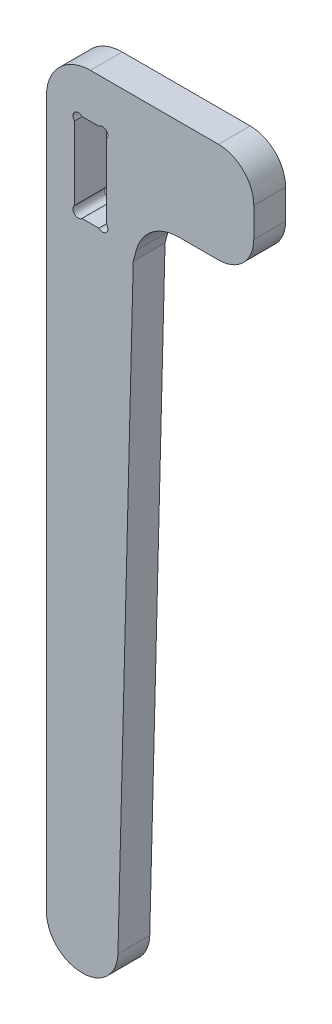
ISO-10303-21;
HEADER;
FILE_DESCRIPTION(('STEP AP214'),'2;1');
FILE_NAME('part.step','',(''),(''),'','','');
FILE_SCHEMA(('AUTOMOTIVE_DESIGN { 1 0 10303 214 1 1 1 1 }'));
ENDSEC;
DATA;
#1=APPLICATION_CONTEXT('core data for automotive mechanical design processes');
#2=APPLICATION_PROTOCOL_DEFINITION('international standard','automotive_design',2000,#1);
#3=PRODUCT_CONTEXT('',#1,'mechanical');
#4=PRODUCT('Part','Part','',(#3));
#5=PRODUCT_RELATED_PRODUCT_CATEGORY('part','',(#4));
#6=PRODUCT_DEFINITION_FORMATION('','',#4);
#7=PRODUCT_DEFINITION_CONTEXT('part definition',#1,'design');
#8=PRODUCT_DEFINITION('design','',#6,#7);
#9=PRODUCT_DEFINITION_SHAPE('','',#8);
#10=(LENGTH_UNIT() NAMED_UNIT(*) SI_UNIT(.MILLI.,.METRE.));
#11=(NAMED_UNIT(*) PLANE_ANGLE_UNIT() SI_UNIT($,.RADIAN.));
#12=(NAMED_UNIT(*) SI_UNIT($,.STERADIAN.) SOLID_ANGLE_UNIT());
#13=UNCERTAINTY_MEASURE_WITH_UNIT(LENGTH_MEASURE(1.E-05),#10,'distance_accuracy_value','');
#14=(GEOMETRIC_REPRESENTATION_CONTEXT(3) GLOBAL_UNCERTAINTY_ASSIGNED_CONTEXT((#13)) GLOBAL_UNIT_ASSIGNED_CONTEXT((#10,
#11,#12)) REPRESENTATION_CONTEXT('',''));
#15=CARTESIAN_POINT('',(0.,0.,0.));
#16=DIRECTION('',(0.,0.,1.));
#17=DIRECTION('',(1.,0.,0.));
#18=AXIS2_PLACEMENT_3D('',#15,#16,#17);
#19=CARTESIAN_POINT('',(24.9,25.1,18.));
#20=DIRECTION('',(0.,0.,-1.));
#21=DIRECTION('',(-1.,0.,0.));
#22=AXIS2_PLACEMENT_3D('',#19,#20,#21);
#23=CYLINDRICAL_SURFACE('',#22,24.9);
#24=CARTESIAN_POINT('',(24.9,25.1,0.));
#25=DIRECTION('',(0.,0.,1.));
#26=DIRECTION('',(1.,0.,0.));
#27=AXIS2_PLACEMENT_3D('',#24,#25,#26);
#28=CIRCLE('',#27,24.9);
#29=CARTESIAN_POINT('',(0.,25.0999999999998,0.));
#30=VERTEX_POINT('',#29);
#31=CARTESIAN_POINT('',(24.9000000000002,50.,0.));
#32=VERTEX_POINT('',#31);
#33=EDGE_CURVE('E246',#30,#32,#28,.F.);
#34=ORIENTED_EDGE('',*,*,#33,.F.);
#35=DIRECTION('',(0.,0.,-1.));
#36=VECTOR('',#35,1.);
#37=CARTESIAN_POINT('',(0.,25.0999999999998,18.));
#38=LINE('',#37,#36);
#39=CARTESIAN_POINT('',(0.,25.0999999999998,18.));
#40=VERTEX_POINT('',#39);
#41=EDGE_CURVE('E280',#40,#30,#38,.T.);
#42=ORIENTED_EDGE('',*,*,#41,.F.);
#43=CARTESIAN_POINT('',(24.9,25.1,18.));
#44=DIRECTION('',(0.,0.,1.));
#45=DIRECTION('',(1.,0.,0.));
#46=AXIS2_PLACEMENT_3D('',#43,#44,#45);
#47=CIRCLE('',#46,24.9);
#48=CARTESIAN_POINT('',(24.9000000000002,50.,18.));
#49=VERTEX_POINT('',#48);
#50=EDGE_CURVE('E218',#40,#49,#47,.F.);
#51=ORIENTED_EDGE('',*,*,#50,.T.);
#52=DIRECTION('',(0.,0.,-1.));
#53=VECTOR('',#52,1.);
#54=CARTESIAN_POINT('',(24.9000000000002,50.,18.));
#55=LINE('',#54,#53);
#56=EDGE_CURVE('E245',#49,#32,#55,.T.);
#57=ORIENTED_EDGE('',*,*,#56,.T.);
#58=EDGE_LOOP('',(#34,#42,#51,#57));
#59=FACE_BOUND('',#58,.T.);
#60=ADVANCED_FACE('F35',(#59),#23,.T.);
#61=CARTESIAN_POINT('',(0.,0.,18.));
#62=DIRECTION('',(1.,0.,0.));
#63=DIRECTION('',(0.,1.,0.));
#64=AXIS2_PLACEMENT_3D('',#61,#62,#63);
#65=PLANE('',#64);
#66=DIRECTION('',(0.,-1.,0.));
#67=VECTOR('',#66,1.);
#68=CARTESIAN_POINT('',(0.,0.,0.));
#69=LINE('',#68,#67);
#70=CARTESIAN_POINT('',(0.,-374.9,0.));
#71=VERTEX_POINT('',#70);
#72=EDGE_CURVE('E249',#30,#71,#69,.T.);
#73=ORIENTED_EDGE('',*,*,#72,.T.);
#74=DIRECTION('',(0.,0.,-1.));
#75=VECTOR('',#74,1.);
#76=CARTESIAN_POINT('',(0.,-374.9,18.));
#77=LINE('',#76,#75);
#78=CARTESIAN_POINT('',(0.,-374.9,18.));
#79=VERTEX_POINT('',#78);
#80=EDGE_CURVE('E309',#71,#79,#77,.F.);
#81=ORIENTED_EDGE('',*,*,#80,.T.);
#82=DIRECTION('',(0.,-1.,0.));
#83=VECTOR('',#82,1.);
#84=CARTESIAN_POINT('',(0.,0.,18.));
#85=LINE('',#84,#83);
#86=EDGE_CURVE('E221',#40,#79,#85,.T.);
#87=ORIENTED_EDGE('',*,*,#86,.F.);
#88=ORIENTED_EDGE('',*,*,#41,.T.);
#89=EDGE_LOOP('',(#73,#81,#87,#88));
#90=FACE_BOUND('',#89,.T.);
#91=ADVANCED_FACE('F373',(#90),#65,.F.);
#92=CARTESIAN_POINT('',(0.,-394.9,18.));
#93=DIRECTION('',(0.,1.,0.));
#94=DIRECTION('',(0.,0.,1.));
#95=AXIS2_PLACEMENT_3D('',#92,#93,#94);
#96=PLANE('',#95);
#97=DIRECTION('',(1.,0.,0.));
#98=VECTOR('',#97,1.);
#99=CARTESIAN_POINT('',(0.,-394.9,18.));
#100=LINE('',#99,#98);
#101=CARTESIAN_POINT('',(20.,-394.9,18.));
#102=VERTEX_POINT('',#101);
#103=CARTESIAN_POINT('',(20.4974080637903,-394.9,18.));
#104=VERTEX_POINT('',#103);
#105=EDGE_CURVE('E225',#102,#104,#100,.T.);
#106=ORIENTED_EDGE('',*,*,#105,.F.);
#107=DIRECTION('',(0.,0.,-1.));
#108=VECTOR('',#107,1.);
#109=CARTESIAN_POINT('',(20.,-394.9,18.));
#110=LINE('',#109,#108);
#111=CARTESIAN_POINT('',(20.,-394.9,0.));
#112=VERTEX_POINT('',#111);
#113=EDGE_CURVE('E302',#102,#112,#110,.T.);
#114=ORIENTED_EDGE('',*,*,#113,.T.);
#115=DIRECTION('',(1.,0.,0.));
#116=VECTOR('',#115,1.);
#117=CARTESIAN_POINT('',(0.,-394.9,0.));
#118=LINE('',#117,#116);
#119=CARTESIAN_POINT('',(20.4974080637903,-394.9,0.));
#120=VERTEX_POINT('',#119);
#121=EDGE_CURVE('E253',#112,#120,#118,.T.);
#122=ORIENTED_EDGE('',*,*,#121,.T.);
#123=DIRECTION('',(0.,0.,-1.));
#124=VECTOR('',#123,1.);
#125=CARTESIAN_POINT('',(20.4974080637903,-394.9,18.));
#126=LINE('',#125,#124);
#127=EDGE_CURVE('E300',#120,#104,#126,.F.);
#128=ORIENTED_EDGE('',*,*,#127,.T.);
#129=EDGE_LOOP('',(#106,#114,#122,#128));
#130=FACE_BOUND('',#129,.T.);
#131=ADVANCED_FACE('F379',(#130),#96,.F.);
#132=CARTESIAN_POINT('',(49.914900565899,-1.25723452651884,18.));
#133=DIRECTION('',(0.999682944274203,-0.0251795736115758,0.));
#134=DIRECTION('',(0.0251795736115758,0.999682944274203,0.));
#135=AXIS2_PLACEMENT_3D('',#132,#133,#134);
#136=PLANE('',#135);
#137=DIRECTION('',(-0.0251795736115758,-0.999682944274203,0.));
#138=VECTOR('',#137,1.);
#139=CARTESIAN_POINT('',(49.914900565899,-1.25723452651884,18.));
#140=LINE('',#139,#138);
#141=CARTESIAN_POINT('',(49.1520859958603,-31.5426050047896,18.));
#142=VERTEX_POINT('',#141);
#143=CARTESIAN_POINT('',(40.4910669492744,-375.403591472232,18.));
#144=VERTEX_POINT('',#143);
#145=EDGE_CURVE('E228',#142,#144,#140,.T.);
#146=ORIENTED_EDGE('',*,*,#145,.T.);
#147=DIRECTION('',(0.,0.,-1.));
#148=VECTOR('',#147,1.);
#149=CARTESIAN_POINT('',(40.4910669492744,-375.403591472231,0.));
#150=LINE('',#149,#148);
#151=CARTESIAN_POINT('',(40.4910669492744,-375.403591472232,0.));
#152=VERTEX_POINT('',#151);
#153=EDGE_CURVE('E201',#144,#152,#150,.T.);
#154=ORIENTED_EDGE('',*,*,#153,.T.);
#155=DIRECTION('',(-0.0251795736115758,-0.999682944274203,0.));
#156=VECTOR('',#155,1.);
#157=CARTESIAN_POINT('',(49.914900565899,-1.25723452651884,0.));
#158=LINE('',#157,#156);
#159=CARTESIAN_POINT('',(49.1520859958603,-31.5426050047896,0.));
#160=VERTEX_POINT('',#159);
#161=EDGE_CURVE('E256',#160,#152,#158,.T.);
#162=ORIENTED_EDGE('',*,*,#161,.F.);
#163=DIRECTION('',(0.,0.,-1.));
#164=VECTOR('',#163,1.);
#165=CARTESIAN_POINT('',(49.1520859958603,-31.5426050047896,18.));
#166=LINE('',#165,#164);
#167=EDGE_CURVE('E278',#142,#160,#166,.T.);
#168=ORIENTED_EDGE('',*,*,#167,.F.);
#169=EDGE_LOOP('',(#146,#154,#162,#168));
#170=FACE_BOUND('',#169,.T.);
#171=ADVANCED_FACE('F412',(#170),#136,.T.);
#172=CARTESIAN_POINT('',(53.744944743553,-14.3961505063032,18.));
#173=DIRECTION('',(-0.965947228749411,0.258739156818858,0.));
#174=DIRECTION('',(-0.258739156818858,-0.965947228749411,0.));
#175=AXIS2_PLACEMENT_3D('',#172,#173,#174);
#176=PLANE('',#175);
#177=DIRECTION('',(0.258739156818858,0.965947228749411,0.));
#178=VECTOR('',#177,1.);
#179=CARTESIAN_POINT('',(53.744944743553,-14.3961505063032,0.));
#180=LINE('',#179,#178);
#181=CARTESIAN_POINT('',(50.8479140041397,-25.2115943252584,0.));
#182=VERTEX_POINT('',#181);
#183=EDGE_CURVE('E259',#160,#182,#180,.T.);
#184=ORIENTED_EDGE('',*,*,#183,.T.);
#185=DIRECTION('',(0.,0.,-1.));
#186=VECTOR('',#185,1.);
#187=CARTESIAN_POINT('',(50.8479140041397,-25.2115943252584,18.));
#188=LINE('',#187,#186);
#189=CARTESIAN_POINT('',(50.8479140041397,-25.2115943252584,18.));
#190=VERTEX_POINT('',#189);
#191=EDGE_CURVE('E276',#190,#182,#188,.T.);
#192=ORIENTED_EDGE('',*,*,#191,.F.);
#193=DIRECTION('',(0.258739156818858,0.965947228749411,0.));
#194=VECTOR('',#193,1.);
#195=CARTESIAN_POINT('',(53.744944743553,-14.3961505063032,18.));
#196=LINE('',#195,#194);
#197=EDGE_CURVE('E231',#142,#190,#196,.T.);
#198=ORIENTED_EDGE('',*,*,#197,.F.);
#199=ORIENTED_EDGE('',*,*,#167,.T.);
#200=EDGE_LOOP('',(#184,#192,#198,#199));
#201=FACE_BOUND('',#200,.T.);
#202=ADVANCED_FACE('F418',(#201),#176,.F.);
#203=CARTESIAN_POINT('',(74.9,-31.654199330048,18.));
#204=DIRECTION('',(0.,0.,-1.));
#205=DIRECTION('',(-1.,0.,0.));
#206=AXIS2_PLACEMENT_3D('',#203,#204,#205);
#207=CYLINDRICAL_SURFACE('',#206,24.9);
#208=CARTESIAN_POINT('',(74.9,-31.654199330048,0.));
#209=DIRECTION('',(0.,0.,1.));
#210=DIRECTION('',(1.,0.,0.));
#211=AXIS2_PLACEMENT_3D('',#208,#209,#210);
#212=CIRCLE('',#211,24.9);
#213=CARTESIAN_POINT('',(74.9,-6.75419933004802,0.));
#214=VERTEX_POINT('',#213);
#215=EDGE_CURVE('E262',#214,#182,#212,.T.);
#216=ORIENTED_EDGE('',*,*,#215,.F.);
#217=DIRECTION('',(0.,0.,-1.));
#218=VECTOR('',#217,1.);
#219=CARTESIAN_POINT('',(74.9,-6.75419933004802,18.));
#220=LINE('',#219,#218);
#221=CARTESIAN_POINT('',(74.9,-6.75419933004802,18.));
#222=VERTEX_POINT('',#221);
#223=EDGE_CURVE('E274',#222,#214,#220,.T.);
#224=ORIENTED_EDGE('',*,*,#223,.F.);
#225=CARTESIAN_POINT('',(74.9,-31.654199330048,18.));
#226=DIRECTION('',(0.,0.,1.));
#227=DIRECTION('',(1.,0.,0.));
#228=AXIS2_PLACEMENT_3D('',#225,#226,#227);
#229=CIRCLE('',#228,24.9);
#230=EDGE_CURVE('E233',#222,#190,#229,.T.);
#231=ORIENTED_EDGE('',*,*,#230,.T.);
#232=ORIENTED_EDGE('',*,*,#191,.T.);
#233=EDGE_LOOP('',(#216,#224,#231,#232));
#234=FACE_BOUND('',#233,.T.);
#235=ADVANCED_FACE('F424',(#234),#207,.F.);
#236=CARTESIAN_POINT('',(0.,-6.75419933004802,18.));
#237=DIRECTION('',(0.,1.,0.));
#238=DIRECTION('',(0.,0.,1.));
#239=AXIS2_PLACEMENT_3D('',#236,#237,#238);
#240=PLANE('',#239);
#241=DIRECTION('',(1.,0.,0.));
#242=VECTOR('',#241,1.);
#243=CARTESIAN_POINT('',(0.,-6.75419933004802,0.));
#244=LINE('',#243,#242);
#245=CARTESIAN_POINT('',(97.3929754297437,-6.75419933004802,0.));
#246=VERTEX_POINT('',#245);
#247=EDGE_CURVE('E265',#214,#246,#244,.T.);
#248=ORIENTED_EDGE('',*,*,#247,.T.);
#249=DIRECTION('',(0.,0.,-1.));
#250=VECTOR('',#249,1.);
#251=CARTESIAN_POINT('',(97.3929754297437,-6.75419933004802,18.));
#252=LINE('',#251,#250);
#253=CARTESIAN_POINT('',(97.3929754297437,-6.75419933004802,18.));
#254=VERTEX_POINT('',#253);
#255=EDGE_CURVE('E291',#246,#254,#252,.F.);
#256=ORIENTED_EDGE('',*,*,#255,.T.);
#257=DIRECTION('',(1.,0.,0.));
#258=VECTOR('',#257,1.);
#259=CARTESIAN_POINT('',(0.,-6.75419933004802,18.));
#260=LINE('',#259,#258);
#261=EDGE_CURVE('E236',#222,#254,#260,.T.);
#262=ORIENTED_EDGE('',*,*,#261,.F.);
#263=ORIENTED_EDGE('',*,*,#223,.T.);
#264=EDGE_LOOP('',(#248,#256,#262,#263));
#265=FACE_BOUND('',#264,.T.);
#266=ADVANCED_FACE('F427',(#265),#240,.F.);
#267=CARTESIAN_POINT('',(117.392975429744,0.,18.));
#268=DIRECTION('',(1.,0.,0.));
#269=DIRECTION('',(0.,0.,-1.));
#270=AXIS2_PLACEMENT_3D('',#267,#268,#269);
#271=PLANE('',#270);
#272=DIRECTION('',(0.,-1.,0.));
#273=VECTOR('',#272,1.);
#274=CARTESIAN_POINT('',(117.392975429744,0.,18.));
#275=LINE('',#274,#273);
#276=CARTESIAN_POINT('',(117.392975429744,30.,18.));
#277=VERTEX_POINT('',#276);
#278=CARTESIAN_POINT('',(117.392975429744,13.245800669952,18.));
#279=VERTEX_POINT('',#278);
#280=EDGE_CURVE('E239',#277,#279,#275,.T.);
#281=ORIENTED_EDGE('',*,*,#280,.T.);
#282=DIRECTION('',(0.,0.,-1.));
#283=VECTOR('',#282,1.);
#284=CARTESIAN_POINT('',(117.392975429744,13.245800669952,0.));
#285=LINE('',#284,#283);
#286=CARTESIAN_POINT('',(117.392975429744,13.245800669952,0.));
#287=VERTEX_POINT('',#286);
#288=EDGE_CURVE('E284',#279,#287,#285,.T.);
#289=ORIENTED_EDGE('',*,*,#288,.T.);
#290=DIRECTION('',(0.,-1.,0.));
#291=VECTOR('',#290,1.);
#292=CARTESIAN_POINT('',(117.392975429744,0.,0.));
#293=LINE('',#292,#291);
#294=CARTESIAN_POINT('',(117.392975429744,30.,0.));
#295=VERTEX_POINT('',#294);
#296=EDGE_CURVE('E268',#295,#287,#293,.T.);
#297=ORIENTED_EDGE('',*,*,#296,.F.);
#298=DIRECTION('',(0.,0.,-1.));
#299=VECTOR('',#298,1.);
#300=CARTESIAN_POINT('',(117.392975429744,30.,18.));
#301=LINE('',#300,#299);
#302=EDGE_CURVE('E282',#295,#277,#301,.F.);
#303=ORIENTED_EDGE('',*,*,#302,.T.);
#304=EDGE_LOOP('',(#281,#289,#297,#303));
#305=FACE_BOUND('',#304,.T.);
#306=ADVANCED_FACE('F433',(#305),#271,.T.);
#307=CARTESIAN_POINT('',(0.,50.,18.));
#308=DIRECTION('',(0.,1.,0.));
#309=DIRECTION('',(-1.,0.,0.));
#310=AXIS2_PLACEMENT_3D('',#307,#308,#309);
#311=PLANE('',#310);
#312=DIRECTION('',(1.,0.,0.));
#313=VECTOR('',#312,1.);
#314=CARTESIAN_POINT('',(0.,50.,18.));
#315=LINE('',#314,#313);
#316=CARTESIAN_POINT('',(97.3929754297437,50.,18.));
#317=VERTEX_POINT('',#316);
#318=EDGE_CURVE('E242',#49,#317,#315,.T.);
#319=ORIENTED_EDGE('',*,*,#318,.T.);
#320=DIRECTION('',(0.,0.,-1.));
#321=VECTOR('',#320,1.);
#322=CARTESIAN_POINT('',(97.3929754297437,50.,18.));
#323=LINE('',#322,#321);
#324=CARTESIAN_POINT('',(97.3929754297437,50.,0.));
#325=VERTEX_POINT('',#324);
#326=EDGE_CURVE('E297',#317,#325,#323,.T.);
#327=ORIENTED_EDGE('',*,*,#326,.T.);
#328=DIRECTION('',(1.,0.,0.));
#329=VECTOR('',#328,1.);
#330=CARTESIAN_POINT('',(0.,50.,0.));
#331=LINE('',#330,#329);
#332=EDGE_CURVE('E222',#32,#325,#331,.T.);
#333=ORIENTED_EDGE('',*,*,#332,.F.);
#334=ORIENTED_EDGE('',*,*,#56,.F.);
#335=EDGE_LOOP('',(#319,#327,#333,#334));
#336=FACE_BOUND('',#335,.T.);
#337=ADVANCED_FACE('F439',(#336),#311,.T.);
#338=CARTESIAN_POINT('',(0.,0.,18.));
#339=DIRECTION('',(0.,0.,1.));
#340=DIRECTION('',(1.,0.,0.));
#341=AXIS2_PLACEMENT_3D('',#338,#339,#340);
#342=PLANE('',#341);
#343=CARTESIAN_POINT('',(18.0213203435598,-22.8786796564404,18.));
#344=DIRECTION('',(0.,0.,1.));
#345=DIRECTION('',(-1.,0.,0.));
#346=AXIS2_PLACEMENT_3D('',#343,#344,#345);
#347=CIRCLE('',#346,3.);
#348=CARTESIAN_POINT('',(15.9000000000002,-20.7573593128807,18.));
#349=VERTEX_POINT('',#348);
#350=CARTESIAN_POINT('',(20.1426406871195,-25.,18.));
#351=VERTEX_POINT('',#350);
#352=EDGE_CURVE('E344',#349,#351,#347,.T.);
#353=ORIENTED_EDGE('',*,*,#352,.F.);
#354=DIRECTION('',(0.,-1.,0.));
#355=VECTOR('',#354,1.);
#356=CARTESIAN_POINT('',(15.9000000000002,-25.,18.));
#357=LINE('',#356,#355);
#358=CARTESIAN_POINT('',(15.9000000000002,20.7573593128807,18.));
#359=VERTEX_POINT('',#358);
#360=EDGE_CURVE('E187',#359,#349,#357,.T.);
#361=ORIENTED_EDGE('',*,*,#360,.F.);
#362=CARTESIAN_POINT('',(18.0213203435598,22.8786796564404,18.));
#363=DIRECTION('',(0.,0.,1.));
#364=DIRECTION('',(1.,0.,0.));
#365=AXIS2_PLACEMENT_3D('',#362,#363,#364);
#366=CIRCLE('',#365,3.);
#367=CARTESIAN_POINT('',(20.1426406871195,25.,18.));
#368=VERTEX_POINT('',#367);
#369=EDGE_CURVE('E179',#368,#359,#366,.T.);
#370=ORIENTED_EDGE('',*,*,#369,.F.);
#371=DIRECTION('',(-1.,0.,0.));
#372=VECTOR('',#371,1.);
#373=CARTESIAN_POINT('',(15.9000000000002,25.,18.));
#374=LINE('',#373,#372);
#375=CARTESIAN_POINT('',(29.6573593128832,25.,18.));
#376=VERTEX_POINT('',#375);
#377=EDGE_CURVE('E185',#376,#368,#374,.T.);
#378=ORIENTED_EDGE('',*,*,#377,.F.);
#379=CARTESIAN_POINT('',(31.7786796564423,22.8786796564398,18.));
#380=DIRECTION('',(0.,0.,1.));
#381=DIRECTION('',(-1.,0.,0.));
#382=AXIS2_PLACEMENT_3D('',#379,#380,#381);
#383=CIRCLE('',#382,3.);
#384=CARTESIAN_POINT('',(33.9000000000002,20.7573593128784,18.));
#385=VERTEX_POINT('',#384);
#386=EDGE_CURVE('E350',#385,#376,#383,.T.);
#387=ORIENTED_EDGE('',*,*,#386,.F.);
#388=DIRECTION('',(0.,1.,0.));
#389=VECTOR('',#388,1.);
#390=CARTESIAN_POINT('',(33.9000000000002,-25.,18.));
#391=LINE('',#390,#389);
#392=CARTESIAN_POINT('',(33.9000000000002,-20.7573593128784,18.));
#393=VERTEX_POINT('',#392);
#394=EDGE_CURVE('E206',#393,#385,#391,.T.);
#395=ORIENTED_EDGE('',*,*,#394,.F.);
#396=CARTESIAN_POINT('',(31.7786796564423,-22.8786796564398,18.));
#397=DIRECTION('',(0.,0.,1.));
#398=DIRECTION('',(1.,0.,0.));
#399=AXIS2_PLACEMENT_3D('',#396,#397,#398);
#400=CIRCLE('',#399,3.);
#401=CARTESIAN_POINT('',(29.6573593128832,-25.,18.));
#402=VERTEX_POINT('',#401);
#403=EDGE_CURVE('E347',#402,#393,#400,.T.);
#404=ORIENTED_EDGE('',*,*,#403,.F.);
#405=DIRECTION('',(1.,0.,0.));
#406=VECTOR('',#405,1.);
#407=CARTESIAN_POINT('',(15.9000000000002,-25.,18.));
#408=LINE('',#407,#406);
#409=EDGE_CURVE('E208',#351,#402,#408,.T.);
#410=ORIENTED_EDGE('',*,*,#409,.F.);
#411=EDGE_LOOP('',(#353,#361,#370,#378,#387,#395,#404,#410));
#412=FACE_BOUND('',#411,.T.);
#413=ORIENTED_EDGE('',*,*,#86,.T.);
#414=CARTESIAN_POINT('',(20.,-374.9,18.));
#415=DIRECTION('',(0.,0.,1.));
#416=DIRECTION('',(1.,0.,0.));
#417=AXIS2_PLACEMENT_3D('',#414,#415,#416);
#418=CIRCLE('',#417,20.);
#419=EDGE_CURVE('E313',#79,#102,#418,.T.);
#420=ORIENTED_EDGE('',*,*,#419,.T.);
#421=ORIENTED_EDGE('',*,*,#105,.T.);
#422=CARTESIAN_POINT('',(20.4974080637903,-374.9,18.));
#423=DIRECTION('',(0.,0.,1.));
#424=DIRECTION('',(1.,0.,0.));
#425=AXIS2_PLACEMENT_3D('',#422,#423,#424);
#426=CIRCLE('',#425,20.);
#427=EDGE_CURVE('E311',#104,#144,#426,.T.);
#428=ORIENTED_EDGE('',*,*,#427,.T.);
#429=ORIENTED_EDGE('',*,*,#145,.F.);
#430=ORIENTED_EDGE('',*,*,#197,.T.);
#431=ORIENTED_EDGE('',*,*,#230,.F.);
#432=ORIENTED_EDGE('',*,*,#261,.T.);
#433=CARTESIAN_POINT('',(97.3929754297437,13.245800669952,18.));
#434=DIRECTION('',(0.,0.,1.));
#435=DIRECTION('',(1.,0.,0.));
#436=AXIS2_PLACEMENT_3D('',#433,#434,#435);
#437=CIRCLE('',#436,20.);
#438=EDGE_CURVE('E295',#254,#279,#437,.T.);
#439=ORIENTED_EDGE('',*,*,#438,.T.);
#440=ORIENTED_EDGE('',*,*,#280,.F.);
#441=CARTESIAN_POINT('',(97.3929754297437,30.,18.));
#442=DIRECTION('',(0.,0.,1.));
#443=DIRECTION('',(1.,0.,0.));
#444=AXIS2_PLACEMENT_3D('',#441,#442,#443);
#445=CIRCLE('',#444,20.);
#446=EDGE_CURVE('E293',#277,#317,#445,.T.);
#447=ORIENTED_EDGE('',*,*,#446,.T.);
#448=ORIENTED_EDGE('',*,*,#318,.F.);
#449=ORIENTED_EDGE('',*,*,#50,.F.);
#450=EDGE_LOOP('',(#413,#420,#421,#428,#429,#430,#431,#432,#439,#440,#447,#448,#449));
#451=FACE_BOUND('',#450,.T.);
#452=ADVANCED_FACE('F181',(#412,#451),#342,.T.);
#453=CARTESIAN_POINT('',(0.,0.,0.));
#454=DIRECTION('',(0.,0.,1.));
#455=DIRECTION('',(1.,0.,0.));
#456=AXIS2_PLACEMENT_3D('',#453,#454,#455);
#457=PLANE('',#456);
#458=DIRECTION('',(0.,-1.,0.));
#459=VECTOR('',#458,1.);
#460=CARTESIAN_POINT('',(15.9000000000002,-25.,0.));
#461=LINE('',#460,#459);
#462=CARTESIAN_POINT('',(15.9000000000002,20.7573593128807,0.));
#463=VERTEX_POINT('',#462);
#464=CARTESIAN_POINT('',(15.9000000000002,-20.7573593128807,0.));
#465=VERTEX_POINT('',#464);
#466=EDGE_CURVE('E321',#463,#465,#461,.T.);
#467=ORIENTED_EDGE('',*,*,#466,.T.);
#468=CARTESIAN_POINT('',(18.0213203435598,-22.8786796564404,0.));
#469=DIRECTION('',(0.,0.,1.));
#470=DIRECTION('',(-1.,0.,0.));
#471=AXIS2_PLACEMENT_3D('',#468,#469,#470);
#472=CIRCLE('',#471,3.);
#473=CARTESIAN_POINT('',(20.1426406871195,-25.,0.));
#474=VERTEX_POINT('',#473);
#475=EDGE_CURVE('E57',#465,#474,#472,.T.);
#476=ORIENTED_EDGE('',*,*,#475,.T.);
#477=DIRECTION('',(1.,0.,0.));
#478=VECTOR('',#477,1.);
#479=CARTESIAN_POINT('',(15.9000000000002,-25.,0.));
#480=LINE('',#479,#478);
#481=CARTESIAN_POINT('',(29.6573593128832,-25.,0.));
#482=VERTEX_POINT('',#481);
#483=EDGE_CURVE('E250',#474,#482,#480,.T.);
#484=ORIENTED_EDGE('',*,*,#483,.T.);
#485=CARTESIAN_POINT('',(31.7786796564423,-22.8786796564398,0.));
#486=DIRECTION('',(0.,0.,1.));
#487=DIRECTION('',(1.,0.,0.));
#488=AXIS2_PLACEMENT_3D('',#485,#486,#487);
#489=CIRCLE('',#488,3.);
#490=CARTESIAN_POINT('',(33.9000000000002,-20.7573593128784,0.));
#491=VERTEX_POINT('',#490);
#492=EDGE_CURVE('E50',#482,#491,#489,.T.);
#493=ORIENTED_EDGE('',*,*,#492,.T.);
#494=DIRECTION('',(0.,1.,0.));
#495=VECTOR('',#494,1.);
#496=CARTESIAN_POINT('',(33.9000000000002,-25.,0.));
#497=LINE('',#496,#495);
#498=CARTESIAN_POINT('',(33.9000000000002,20.7573593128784,0.));
#499=VERTEX_POINT('',#498);
#500=EDGE_CURVE('E217',#491,#499,#497,.T.);
#501=ORIENTED_EDGE('',*,*,#500,.T.);
#502=CARTESIAN_POINT('',(31.7786796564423,22.8786796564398,0.));
#503=DIRECTION('',(0.,0.,1.));
#504=DIRECTION('',(-1.,0.,0.));
#505=AXIS2_PLACEMENT_3D('',#502,#503,#504);
#506=CIRCLE('',#505,3.);
#507=CARTESIAN_POINT('',(29.6573593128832,25.,0.));
#508=VERTEX_POINT('',#507);
#509=EDGE_CURVE('E191',#499,#508,#506,.T.);
#510=ORIENTED_EDGE('',*,*,#509,.T.);
#511=DIRECTION('',(-1.,0.,0.));
#512=VECTOR('',#511,1.);
#513=CARTESIAN_POINT('',(15.9000000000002,25.,0.));
#514=LINE('',#513,#512);
#515=CARTESIAN_POINT('',(20.1426406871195,25.,0.));
#516=VERTEX_POINT('',#515);
#517=EDGE_CURVE('E327',#508,#516,#514,.T.);
#518=ORIENTED_EDGE('',*,*,#517,.T.);
#519=CARTESIAN_POINT('',(18.0213203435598,22.8786796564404,0.));
#520=DIRECTION('',(0.,0.,1.));
#521=DIRECTION('',(1.,0.,0.));
#522=AXIS2_PLACEMENT_3D('',#519,#520,#521);
#523=CIRCLE('',#522,3.);
#524=EDGE_CURVE('E190',#516,#463,#523,.T.);
#525=ORIENTED_EDGE('',*,*,#524,.T.);
#526=EDGE_LOOP('',(#467,#476,#484,#493,#501,#510,#518,#525));
#527=FACE_BOUND('',#526,.T.);
#528=ORIENTED_EDGE('',*,*,#121,.F.);
#529=CARTESIAN_POINT('',(20.,-374.9,0.));
#530=DIRECTION('',(0.,0.,1.));
#531=DIRECTION('',(1.,0.,0.));
#532=AXIS2_PLACEMENT_3D('',#529,#530,#531);
#533=CIRCLE('',#532,20.);
#534=EDGE_CURVE('E307',#112,#71,#533,.F.);
#535=ORIENTED_EDGE('',*,*,#534,.T.);
#536=ORIENTED_EDGE('',*,*,#72,.F.);
#537=ORIENTED_EDGE('',*,*,#33,.T.);
#538=ORIENTED_EDGE('',*,*,#332,.T.);
#539=CARTESIAN_POINT('',(97.3929754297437,30.,0.));
#540=DIRECTION('',(0.,0.,1.));
#541=DIRECTION('',(1.,0.,0.));
#542=AXIS2_PLACEMENT_3D('',#539,#540,#541);
#543=CIRCLE('',#542,20.);
#544=EDGE_CURVE('E287',#325,#295,#543,.F.);
#545=ORIENTED_EDGE('',*,*,#544,.T.);
#546=ORIENTED_EDGE('',*,*,#296,.T.);
#547=CARTESIAN_POINT('',(97.3929754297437,13.245800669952,0.));
#548=DIRECTION('',(0.,0.,1.));
#549=DIRECTION('',(1.,0.,0.));
#550=AXIS2_PLACEMENT_3D('',#547,#548,#549);
#551=CIRCLE('',#550,20.);
#552=EDGE_CURVE('E289',#287,#246,#551,.F.);
#553=ORIENTED_EDGE('',*,*,#552,.T.);
#554=ORIENTED_EDGE('',*,*,#247,.F.);
#555=ORIENTED_EDGE('',*,*,#215,.T.);
#556=ORIENTED_EDGE('',*,*,#183,.F.);
#557=ORIENTED_EDGE('',*,*,#161,.T.);
#558=CARTESIAN_POINT('',(20.4974080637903,-374.9,0.));
#559=DIRECTION('',(0.,0.,1.));
#560=DIRECTION('',(1.,0.,0.));
#561=AXIS2_PLACEMENT_3D('',#558,#559,#560);
#562=CIRCLE('',#561,20.);
#563=EDGE_CURVE('E305',#152,#120,#562,.F.);
#564=ORIENTED_EDGE('',*,*,#563,.T.);
#565=EDGE_LOOP('',(#528,#535,#536,#537,#538,#545,#546,#553,#554,#555,#556,#557,#564));
#566=FACE_BOUND('',#565,.T.);
#567=ADVANCED_FACE('F323',(#527,#566),#457,.F.);
#568=CARTESIAN_POINT('',(97.3929754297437,13.245800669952,18.));
#569=DIRECTION('',(0.,0.,1.));
#570=DIRECTION('',(1.,0.,0.));
#571=AXIS2_PLACEMENT_3D('',#568,#569,#570);
#572=CYLINDRICAL_SURFACE('',#571,20.);
#573=ORIENTED_EDGE('',*,*,#438,.F.);
#574=ORIENTED_EDGE('',*,*,#255,.F.);
#575=ORIENTED_EDGE('',*,*,#552,.F.);
#576=ORIENTED_EDGE('',*,*,#288,.F.);
#577=EDGE_LOOP('',(#573,#574,#575,#576));
#578=FACE_BOUND('',#577,.T.);
#579=ADVANCED_FACE('F385',(#578),#572,.T.);
#580=CARTESIAN_POINT('',(97.3929754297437,30.,18.));
#581=DIRECTION('',(0.,0.,-1.));
#582=DIRECTION('',(-1.,0.,0.));
#583=AXIS2_PLACEMENT_3D('',#580,#581,#582);
#584=CYLINDRICAL_SURFACE('',#583,20.);
#585=ORIENTED_EDGE('',*,*,#446,.F.);
#586=ORIENTED_EDGE('',*,*,#302,.F.);
#587=ORIENTED_EDGE('',*,*,#544,.F.);
#588=ORIENTED_EDGE('',*,*,#326,.F.);
#589=EDGE_LOOP('',(#585,#586,#587,#588));
#590=FACE_BOUND('',#589,.T.);
#591=ADVANCED_FACE('F388',(#590),#584,.T.);
#592=CARTESIAN_POINT('',(20.,-374.9,18.));
#593=DIRECTION('',(0.,0.,-1.));
#594=DIRECTION('',(-1.,0.,0.));
#595=AXIS2_PLACEMENT_3D('',#592,#593,#594);
#596=CYLINDRICAL_SURFACE('',#595,20.);
#597=ORIENTED_EDGE('',*,*,#419,.F.);
#598=ORIENTED_EDGE('',*,*,#80,.F.);
#599=ORIENTED_EDGE('',*,*,#534,.F.);
#600=ORIENTED_EDGE('',*,*,#113,.F.);
#601=EDGE_LOOP('',(#597,#598,#599,#600));
#602=FACE_BOUND('',#601,.T.);
#603=ADVANCED_FACE('F391',(#602),#596,.T.);
#604=CARTESIAN_POINT('',(20.4974080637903,-374.9,18.));
#605=DIRECTION('',(0.,0.,1.));
#606=DIRECTION('',(1.,0.,0.));
#607=AXIS2_PLACEMENT_3D('',#604,#605,#606);
#608=CYLINDRICAL_SURFACE('',#607,20.);
#609=ORIENTED_EDGE('',*,*,#427,.F.);
#610=ORIENTED_EDGE('',*,*,#127,.F.);
#611=ORIENTED_EDGE('',*,*,#563,.F.);
#612=ORIENTED_EDGE('',*,*,#153,.F.);
#613=EDGE_LOOP('',(#609,#610,#611,#612));
#614=FACE_BOUND('',#613,.T.);
#615=ADVANCED_FACE('F37',(#614),#608,.T.);
#616=CARTESIAN_POINT('',(33.9000000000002,-25.,0.));
#617=DIRECTION('',(1.,0.,0.));
#618=DIRECTION('',(0.,0.,-1.));
#619=AXIS2_PLACEMENT_3D('',#616,#617,#618);
#620=PLANE('',#619);
#621=ORIENTED_EDGE('',*,*,#500,.F.);
#622=DIRECTION('',(0.,0.,1.));
#623=VECTOR('',#622,1.);
#624=CARTESIAN_POINT('',(33.9000000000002,-20.7573593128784,0.));
#625=LINE('',#624,#623);
#626=EDGE_CURVE('E211',#491,#393,#625,.T.);
#627=ORIENTED_EDGE('',*,*,#626,.T.);
#628=ORIENTED_EDGE('',*,*,#394,.T.);
#629=DIRECTION('',(0.,0.,1.));
#630=VECTOR('',#629,1.);
#631=CARTESIAN_POINT('',(33.9000000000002,20.7573593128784,0.));
#632=LINE('',#631,#630);
#633=EDGE_CURVE('E338',#385,#499,#632,.F.);
#634=ORIENTED_EDGE('',*,*,#633,.T.);
#635=EDGE_LOOP('',(#621,#627,#628,#634));
#636=FACE_BOUND('',#635,.T.);
#637=ADVANCED_FACE('F357',(#636),#620,.F.);
#638=CARTESIAN_POINT('',(15.9000000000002,-25.,0.));
#639=DIRECTION('',(0.,-1.,0.));
#640=DIRECTION('',(0.,0.,-1.));
#641=AXIS2_PLACEMENT_3D('',#638,#639,#640);
#642=PLANE('',#641);
#643=ORIENTED_EDGE('',*,*,#483,.F.);
#644=DIRECTION('',(0.,0.,1.));
#645=VECTOR('',#644,1.);
#646=CARTESIAN_POINT('',(20.1426406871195,-25.,0.));
#647=LINE('',#646,#645);
#648=EDGE_CURVE('E335',#474,#351,#647,.T.);
#649=ORIENTED_EDGE('',*,*,#648,.T.);
#650=ORIENTED_EDGE('',*,*,#409,.T.);
#651=DIRECTION('',(0.,0.,1.));
#652=VECTOR('',#651,1.);
#653=CARTESIAN_POINT('',(29.6573593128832,-25.,0.));
#654=LINE('',#653,#652);
#655=EDGE_CURVE('E11',#402,#482,#654,.F.);
#656=ORIENTED_EDGE('',*,*,#655,.T.);
#657=EDGE_LOOP('',(#643,#649,#650,#656));
#658=FACE_BOUND('',#657,.T.);
#659=ADVANCED_FACE('F360',(#658),#642,.F.);
#660=CARTESIAN_POINT('',(15.9000000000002,-25.,0.));
#661=DIRECTION('',(-1.,0.,0.));
#662=DIRECTION('',(0.,0.,1.));
#663=AXIS2_PLACEMENT_3D('',#660,#661,#662);
#664=PLANE('',#663);
#665=ORIENTED_EDGE('',*,*,#360,.T.);
#666=DIRECTION('',(0.,0.,1.));
#667=VECTOR('',#666,1.);
#668=CARTESIAN_POINT('',(15.9000000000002,-20.7573593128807,0.));
#669=LINE('',#668,#667);
#670=EDGE_CURVE('E43',#349,#465,#669,.F.);
#671=ORIENTED_EDGE('',*,*,#670,.T.);
#672=ORIENTED_EDGE('',*,*,#466,.F.);
#673=DIRECTION('',(0.,0.,1.));
#674=VECTOR('',#673,1.);
#675=CARTESIAN_POINT('',(15.9000000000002,20.7573593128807,0.));
#676=LINE('',#675,#674);
#677=EDGE_CURVE('E341',#463,#359,#676,.T.);
#678=ORIENTED_EDGE('',*,*,#677,.T.);
#679=EDGE_LOOP('',(#665,#671,#672,#678));
#680=FACE_BOUND('',#679,.T.);
#681=ADVANCED_FACE('F320',(#680),#664,.F.);
#682=CARTESIAN_POINT('',(15.9000000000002,25.,0.));
#683=DIRECTION('',(0.,1.,0.));
#684=DIRECTION('',(0.,0.,1.));
#685=AXIS2_PLACEMENT_3D('',#682,#683,#684);
#686=PLANE('',#685);
#687=ORIENTED_EDGE('',*,*,#517,.F.);
#688=DIRECTION('',(0.,0.,1.));
#689=VECTOR('',#688,1.);
#690=CARTESIAN_POINT('',(29.6573593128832,25.,0.));
#691=LINE('',#690,#689);
#692=EDGE_CURVE('E200',#508,#376,#691,.T.);
#693=ORIENTED_EDGE('',*,*,#692,.T.);
#694=ORIENTED_EDGE('',*,*,#377,.T.);
#695=DIRECTION('',(0.,0.,1.));
#696=VECTOR('',#695,1.);
#697=CARTESIAN_POINT('',(20.1426406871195,25.,0.));
#698=LINE('',#697,#696);
#699=EDGE_CURVE('E194',#368,#516,#698,.F.);
#700=ORIENTED_EDGE('',*,*,#699,.T.);
#701=EDGE_LOOP('',(#687,#693,#694,#700));
#702=FACE_BOUND('',#701,.T.);
#703=ADVANCED_FACE('F204',(#702),#686,.F.);
#704=CARTESIAN_POINT('',(18.0213203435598,22.8786796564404,0.));
#705=DIRECTION('',(0.,0.,1.));
#706=DIRECTION('',(1.,0.,0.));
#707=AXIS2_PLACEMENT_3D('',#704,#705,#706);
#708=CYLINDRICAL_SURFACE('',#707,3.);
#709=ORIENTED_EDGE('',*,*,#524,.F.);
#710=ORIENTED_EDGE('',*,*,#699,.F.);
#711=ORIENTED_EDGE('',*,*,#369,.T.);
#712=ORIENTED_EDGE('',*,*,#677,.F.);
#713=EDGE_LOOP('',(#709,#710,#711,#712));
#714=FACE_BOUND('',#713,.T.);
#715=ADVANCED_FACE('F195',(#714),#708,.F.);
#716=CARTESIAN_POINT('',(31.7786796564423,22.8786796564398,0.));
#717=DIRECTION('',(0.,0.,1.));
#718=DIRECTION('',(1.,0.,0.));
#719=AXIS2_PLACEMENT_3D('',#716,#717,#718);
#720=CYLINDRICAL_SURFACE('',#719,3.);
#721=ORIENTED_EDGE('',*,*,#386,.T.);
#722=ORIENTED_EDGE('',*,*,#692,.F.);
#723=ORIENTED_EDGE('',*,*,#509,.F.);
#724=ORIENTED_EDGE('',*,*,#633,.F.);
#725=EDGE_LOOP('',(#721,#722,#723,#724));
#726=FACE_BOUND('',#725,.T.);
#727=ADVANCED_FACE('F354',(#726),#720,.F.);
#728=CARTESIAN_POINT('',(18.0213203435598,-22.8786796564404,0.));
#729=DIRECTION('',(0.,0.,1.));
#730=DIRECTION('',(1.,0.,0.));
#731=AXIS2_PLACEMENT_3D('',#728,#729,#730);
#732=CYLINDRICAL_SURFACE('',#731,3.);
#733=ORIENTED_EDGE('',*,*,#475,.F.);
#734=ORIENTED_EDGE('',*,*,#670,.F.);
#735=ORIENTED_EDGE('',*,*,#352,.T.);
#736=ORIENTED_EDGE('',*,*,#648,.F.);
#737=EDGE_LOOP('',(#733,#734,#735,#736));
#738=FACE_BOUND('',#737,.T.);
#739=ADVANCED_FACE('F362',(#738),#732,.F.);
#740=CARTESIAN_POINT('',(31.7786796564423,-22.8786796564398,0.));
#741=DIRECTION('',(0.,0.,1.));
#742=DIRECTION('',(1.,0.,0.));
#743=AXIS2_PLACEMENT_3D('',#740,#741,#742);
#744=CYLINDRICAL_SURFACE('',#743,3.);
#745=ORIENTED_EDGE('',*,*,#492,.F.);
#746=ORIENTED_EDGE('',*,*,#655,.F.);
#747=ORIENTED_EDGE('',*,*,#403,.T.);
#748=ORIENTED_EDGE('',*,*,#626,.F.);
#749=EDGE_LOOP('',(#745,#746,#747,#748));
#750=FACE_BOUND('',#749,.T.);
#751=ADVANCED_FACE('F358',(#750),#744,.F.);
#752=CLOSED_SHELL('',(#60,#91,#131,#171,#202,#235,#266,#306,#337,#452,#567,#579,#591,#603,#615,
#637,#659,#681,#703,#715,#727,#739,#751));
#753=MANIFOLD_SOLID_BREP('B2',#752);
#754=ADVANCED_BREP_SHAPE_REPRESENTATION('',(#18,#753),#14);
#755=SHAPE_DEFINITION_REPRESENTATION(#9,#754);
ENDSEC;
END-ISO-10303-21;
